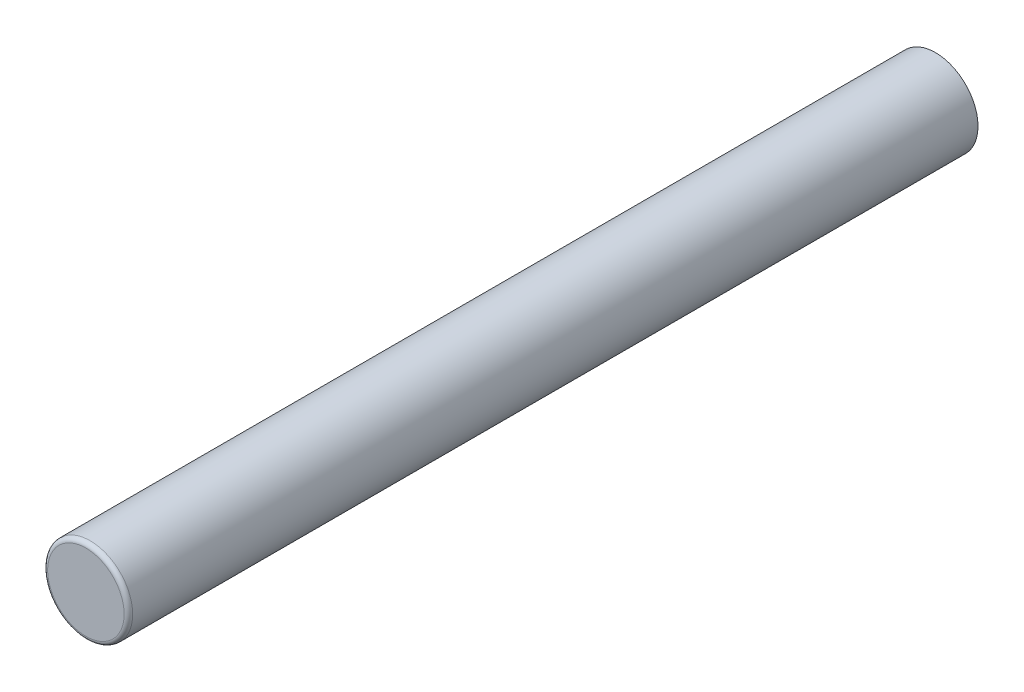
ISO-10303-21;
HEADER;
FILE_DESCRIPTION(('STEP AP214'),'2;1');
FILE_NAME('part.step','',(''),(''),'','','');
FILE_SCHEMA(('AUTOMOTIVE_DESIGN { 1 0 10303 214 1 1 1 1 }'));
ENDSEC;
DATA;
#1=APPLICATION_CONTEXT('core data for automotive mechanical design processes');
#2=APPLICATION_PROTOCOL_DEFINITION('international standard','automotive_design',2000,#1);
#3=PRODUCT_CONTEXT('',#1,'mechanical');
#4=PRODUCT('Part','Part','',(#3));
#5=PRODUCT_RELATED_PRODUCT_CATEGORY('part','',(#4));
#6=PRODUCT_DEFINITION_FORMATION('','',#4);
#7=PRODUCT_DEFINITION_CONTEXT('part definition',#1,'design');
#8=PRODUCT_DEFINITION('design','',#6,#7);
#9=PRODUCT_DEFINITION_SHAPE('','',#8);
#10=(LENGTH_UNIT() NAMED_UNIT(*) SI_UNIT(.MILLI.,.METRE.));
#11=(NAMED_UNIT(*) PLANE_ANGLE_UNIT() SI_UNIT($,.RADIAN.));
#12=(NAMED_UNIT(*) SI_UNIT($,.STERADIAN.) SOLID_ANGLE_UNIT());
#13=UNCERTAINTY_MEASURE_WITH_UNIT(LENGTH_MEASURE(1.E-05),#10,'distance_accuracy_value','');
#14=(GEOMETRIC_REPRESENTATION_CONTEXT(3) GLOBAL_UNCERTAINTY_ASSIGNED_CONTEXT((#13)) GLOBAL_UNIT_ASSIGNED_CONTEXT((#10,
#11,#12)) REPRESENTATION_CONTEXT('',''));
#15=CARTESIAN_POINT('',(0.,0.,0.));
#16=DIRECTION('',(0.,0.,1.));
#17=DIRECTION('',(1.,0.,0.));
#18=AXIS2_PLACEMENT_3D('',#15,#16,#17);
#19=CARTESIAN_POINT('',(0.,0.,10.));
#20=DIRECTION('',(0.,0.,-1.));
#21=DIRECTION('',(-1.,0.,0.));
#22=AXIS2_PLACEMENT_3D('',#19,#20,#21);
#23=CYLINDRICAL_SURFACE('',#22,1.);
#24=CARTESIAN_POINT('',(0.,0.,9.9));
#25=DIRECTION('',(0.,0.,1.));
#26=DIRECTION('',(1.,0.,0.));
#27=AXIS2_PLACEMENT_3D('',#24,#25,#26);
#28=CIRCLE('',#27,1.);
#29=CARTESIAN_POINT('',(1.,0.,9.9));
#30=VERTEX_POINT('',#29);
#31=EDGE_CURVE('E10',#30,#30,#28,.F.);
#32=ORIENTED_EDGE('',*,*,#31,.T.);
#33=EDGE_LOOP('',(#32));
#34=FACE_BOUND('',#33,.T.);
#35=CARTESIAN_POINT('',(0.,0.,-10.));
#36=DIRECTION('',(0.,0.,1.));
#37=DIRECTION('',(1.,0.,0.));
#38=AXIS2_PLACEMENT_3D('',#35,#36,#37);
#39=CIRCLE('',#38,1.);
#40=CARTESIAN_POINT('',(1.,0.,-10.));
#41=VERTEX_POINT('',#40);
#42=EDGE_CURVE('E42',#41,#41,#39,.T.);
#43=ORIENTED_EDGE('',*,*,#42,.T.);
#44=EDGE_LOOP('',(#43));
#45=FACE_BOUND('',#44,.T.);
#46=ADVANCED_FACE('F31',(#34,#45),#23,.T.);
#47=CARTESIAN_POINT('',(0.,0.,10.));
#48=DIRECTION('',(0.,0.,1.));
#49=DIRECTION('',(1.,0.,0.));
#50=AXIS2_PLACEMENT_3D('',#47,#48,#49);
#51=PLANE('',#50);
#52=CARTESIAN_POINT('',(0.,0.,10.));
#53=DIRECTION('',(0.,0.,1.));
#54=DIRECTION('',(1.,0.,0.));
#55=AXIS2_PLACEMENT_3D('',#52,#53,#54);
#56=CIRCLE('',#55,0.900000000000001);
#57=CARTESIAN_POINT('',(0.900000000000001,0.,10.));
#58=VERTEX_POINT('',#57);
#59=EDGE_CURVE('E38',#58,#58,#56,.T.);
#60=ORIENTED_EDGE('',*,*,#59,.T.);
#61=EDGE_LOOP('',(#60));
#62=FACE_BOUND('',#61,.T.);
#63=ADVANCED_FACE('F52',(#62),#51,.T.);
#64=CARTESIAN_POINT('',(0.,0.,-10.));
#65=DIRECTION('',(0.,0.,1.));
#66=DIRECTION('',(1.,0.,0.));
#67=AXIS2_PLACEMENT_3D('',#64,#65,#66);
#68=PLANE('',#67);
#69=ORIENTED_EDGE('',*,*,#42,.F.);
#70=EDGE_LOOP('',(#69));
#71=FACE_BOUND('',#70,.T.);
#72=ADVANCED_FACE('F50',(#71),#68,.F.);
#73=CARTESIAN_POINT('',(0.,0.,9.9));
#74=DIRECTION('',(0.,0.,1.));
#75=DIRECTION('',(1.,0.,0.));
#76=AXIS2_PLACEMENT_3D('',#73,#74,#75);
#77=TOROIDAL_SURFACE('',#76,0.900000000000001,0.1);
#78=ORIENTED_EDGE('',*,*,#31,.F.);
#79=EDGE_LOOP('',(#78));
#80=FACE_BOUND('',#79,.T.);
#81=ORIENTED_EDGE('',*,*,#59,.F.);
#82=EDGE_LOOP('',(#81));
#83=FACE_BOUND('',#82,.T.);
#84=ADVANCED_FACE('F33',(#80,#83),#77,.T.);
#85=CLOSED_SHELL('',(#46,#63,#72,#84));
#86=MANIFOLD_SOLID_BREP('B2',#85);
#87=ADVANCED_BREP_SHAPE_REPRESENTATION('',(#18,#86),#14);
#88=SHAPE_DEFINITION_REPRESENTATION(#9,#87);
ENDSEC;
END-ISO-10303-21;
